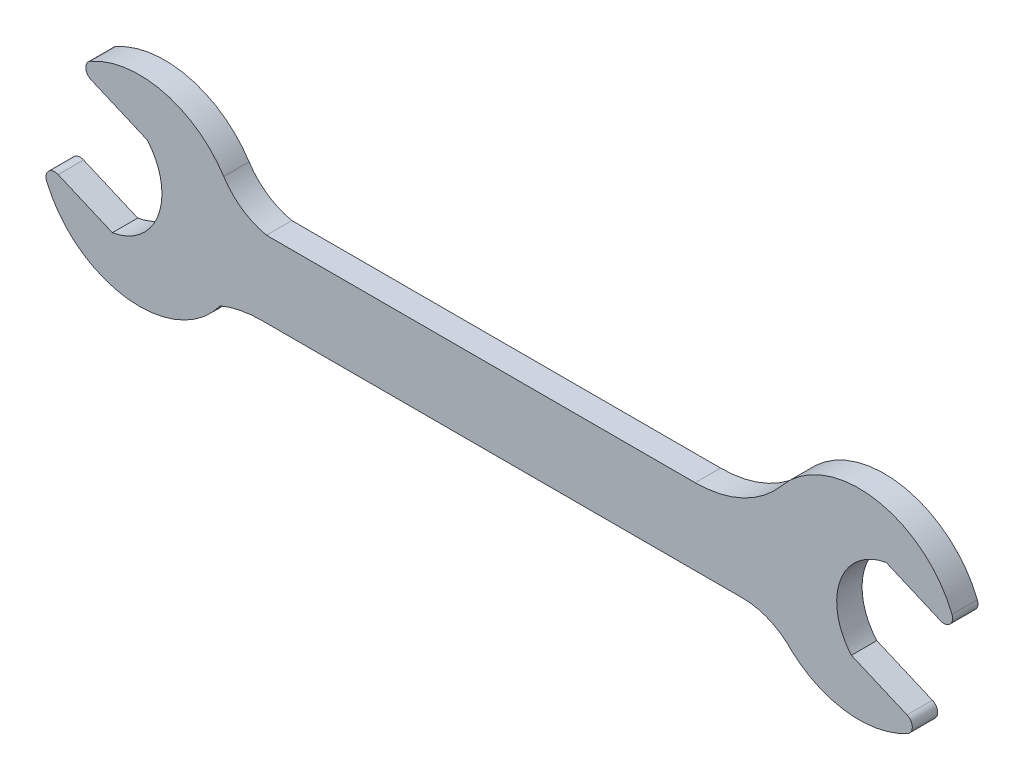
from build123d import *

# Parameters (mm, degrees)
BASE_EXTRUDE_DEPTH = 9.525


with BuildPart() as part:
    # Sketch1 → Base-Extrude (new, symmetric)
    with BuildSketch(Plane(origin=(88.736336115, -76.077228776, 0), x_dir=(1, 0, 0), z_dir=(0, 0, 1))):
        with BuildLine():
            Line((-1.543954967, 356.899172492), (39.136682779, 339.464613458))
            ThreePointArc((39.136682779, 339.464613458), (46.296141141, 340.806016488), (47.781583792, 347.936981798))
            ThreePointArc((47.781583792, 347.936981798), (-10.509067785, 394.076499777), (-79.994572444, 367.648866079))
            ThreePointArc((-79.994572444, 367.648866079), (-109.049280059, 345.101520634), (-144.940131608, 337.076210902))
            Line((-144.940131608, 337.076210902), (-466.70036429, 337.076210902))
            ThreePointArc((-466.70036429, 337.076210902), (-484.930631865, 344.938598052), (-498.746727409, 359.196062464))
            ThreePointArc((-498.746727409, 359.196062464), (-543.750814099, 391.428813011), (-598.628495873, 384.165337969))
            ThreePointArc((-598.628495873, 384.165337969), (-602.271506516, 378.120627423), (-598.307033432, 372.281705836))
            Line((-598.307033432, 372.281705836), (-556.152600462, 354.215520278))
            ThreePointArc((-556.152600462, 354.215520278), (-547.698741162, 309.861120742), (-582.312144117, 280.866417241))
            Line((-582.312144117, 280.866417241), (-622.992781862, 298.300976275))
            ThreePointArc((-622.992781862, 298.300976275), (-630.152240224, 296.959573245), (-631.637682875, 289.828607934))
            ThreePointArc((-631.637682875, 289.828607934), (-571.115143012, 243.691670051), (-501.279904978, 273.93459315))
            ThreePointArc((-501.279904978, 273.93459315), (-485.961142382, 278.414751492), (-470.072410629, 279.926210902))
            Line((-470.072410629, 279.926210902), (-109.39150347, 279.926210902))
            ThreePointArc((-109.39150347, 279.926210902), (-88.842302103, 275.577418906), (-71.816604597, 263.276715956))
            ThreePointArc((-71.816604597, 263.276715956), (-30.075618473, 244.854987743), (14.638173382, 253.929502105))
            ThreePointArc((14.638173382, 253.929502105), (17.989945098, 259.985382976), (14.031800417, 265.663512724))
            Line((14.031800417, 265.663512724), (-27.703498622, 283.550069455))
            ThreePointArc((-27.703498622, 283.550069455), (-36.157357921, 327.904468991), (-1.543954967, 356.899172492))
        make_face()
    extrude(amount=BASE_EXTRUDE_DEPTH, both=True)


solid = part.part
